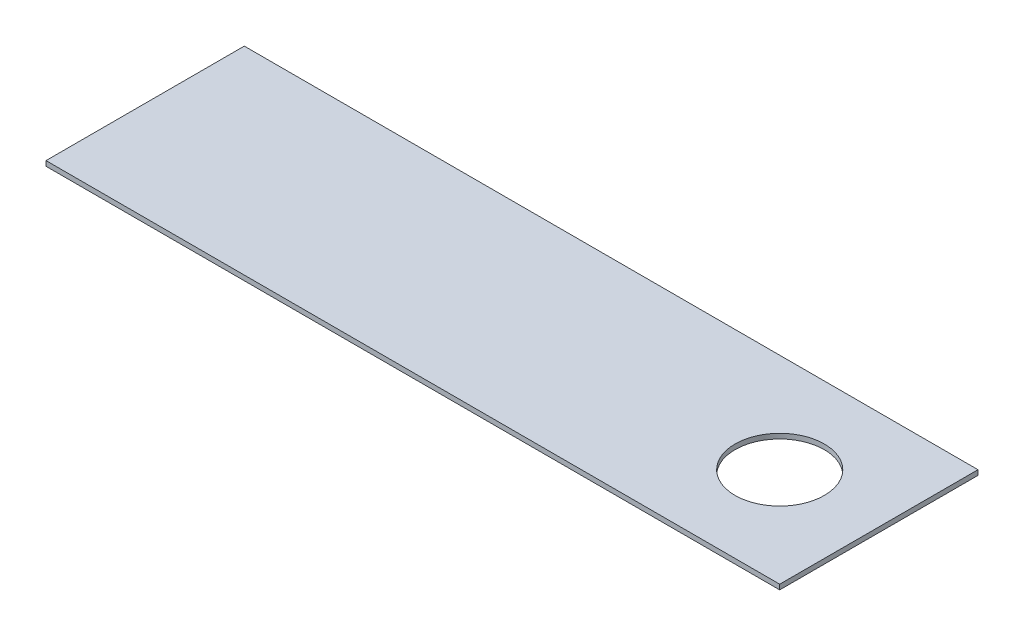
from build123d import *

# Parameters (mm, degrees)
SKETCH1_W      = 37
SKETCH1_H      = 10
SKETCH1_R      = 2.25
EXTRUDE1_DEPTH = 0.25


with BuildPart() as part:
    # Sketch1 → Extrude1 (new body)
    with BuildSketch(Plane(origin=(0, 0, 0), x_dir=(1, 0, 0), z_dir=(0, 1, 0))):
        with Locations((18.5, 5)):
            Rectangle(SKETCH1_W, SKETCH1_H)
        with Locations(Location((32, 5, 0), (0, 0, 270))):
            Circle(SKETCH1_R, mode=Mode.SUBTRACT)
    extrude(amount=EXTRUDE1_DEPTH)


solid = part.part
